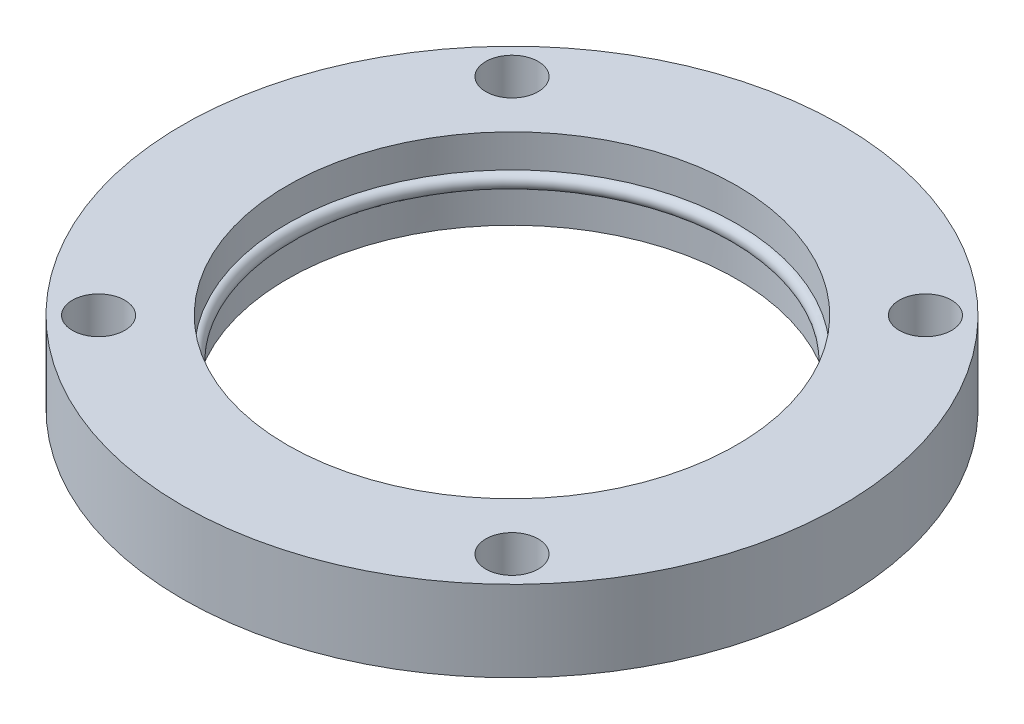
from build123d import *

# Parameters (mm, degrees)
SKETCH2_R           = 110
SKETCH2_R_2         = 75
SKETCH2_R_3         = 8.75
BOSS_EXTRUDE1_DEPTH = 13.5
SKETCH3_R           = 2.5


with BuildPart() as part:
    # Sketch2 → Boss-Extrude1 (new, symmetric)
    with BuildSketch(Plane(origin=(0, 0, 0), x_dir=(1, 0, 0), z_dir=(0, 1, 0))):
        with Locations(Location((0, 0, 0), (0, 0, 270))):
            Circle(SKETCH2_R)
        with Locations(Location((0, 0, 0), (0, 0, 270))):
            Circle(SKETCH2_R_2, mode=Mode.SUBTRACT)
        with Locations(Location((-69, 69, 0), (0, 0, 270))):
            Circle(SKETCH2_R_3, mode=Mode.SUBTRACT)
        with Locations(Location((69, 69, 0), (0, 0, 270))):
            Circle(SKETCH2_R_3, mode=Mode.SUBTRACT)
        with Locations(Location((69, -69, 0), (0, 0, 270))):
            Circle(SKETCH2_R_3, mode=Mode.SUBTRACT)
        with Locations(Location((-69, -69, 0), (0, 0, 270))):
            Circle(SKETCH2_R_3, mode=Mode.SUBTRACT)
    extrude(amount=BOSS_EXTRUDE1_DEPTH, both=True)

    # Sketch3 → Revolve2 (revolve)
    with BuildSketch(Plane.XY, mode=Mode.PRIVATE) as revolve2_sk:
        with Locations((-75, 0)):
            Circle(SKETCH3_R)
    revolve(revolve2_sk.sketch.rotate(Axis((0, 0, 0), (0, 1, 0)), 270), axis=Axis((0, 0, 0), (0, 1, 0)))


solid = part.part
